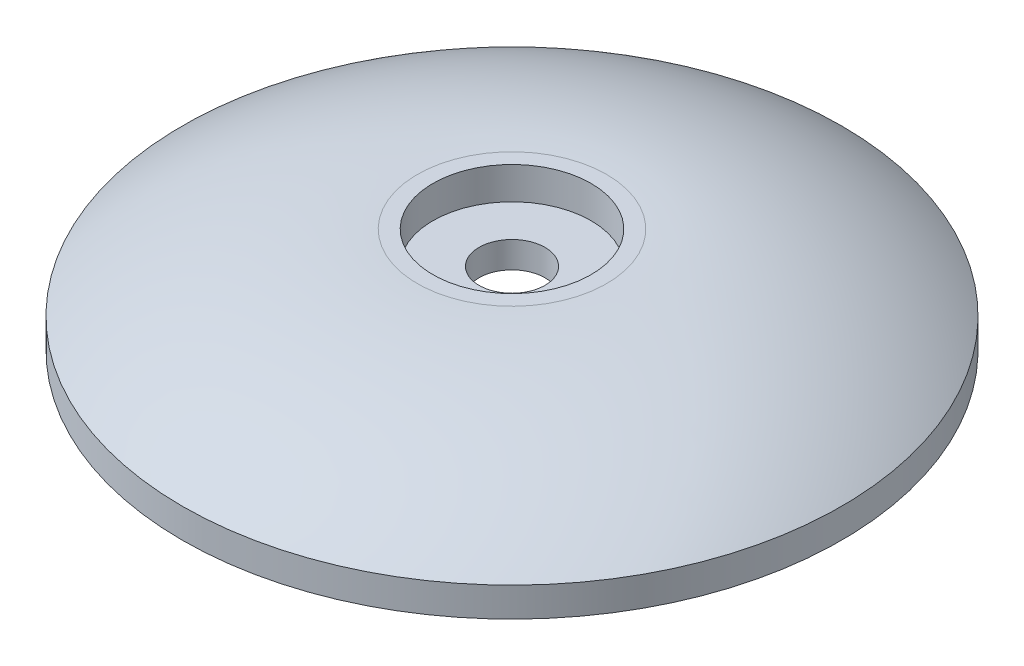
ISO-10303-21;
HEADER;
FILE_DESCRIPTION(('STEP AP214'),'2;1');
FILE_NAME('part.step','',(''),(''),'','','');
FILE_SCHEMA(('AUTOMOTIVE_DESIGN { 1 0 10303 214 1 1 1 1 }'));
ENDSEC;
DATA;
#1=APPLICATION_CONTEXT('core data for automotive mechanical design processes');
#2=APPLICATION_PROTOCOL_DEFINITION('international standard','automotive_design',2000,#1);
#3=PRODUCT_CONTEXT('',#1,'mechanical');
#4=PRODUCT('Part','Part','',(#3));
#5=PRODUCT_RELATED_PRODUCT_CATEGORY('part','',(#4));
#6=PRODUCT_DEFINITION_FORMATION('','',#4);
#7=PRODUCT_DEFINITION_CONTEXT('part definition',#1,'design');
#8=PRODUCT_DEFINITION('design','',#6,#7);
#9=PRODUCT_DEFINITION_SHAPE('','',#8);
#10=(LENGTH_UNIT() NAMED_UNIT(*) SI_UNIT(.MILLI.,.METRE.));
#11=(NAMED_UNIT(*) PLANE_ANGLE_UNIT() SI_UNIT($,.RADIAN.));
#12=(NAMED_UNIT(*) SI_UNIT($,.STERADIAN.) SOLID_ANGLE_UNIT());
#13=UNCERTAINTY_MEASURE_WITH_UNIT(LENGTH_MEASURE(1.E-05),#10,'distance_accuracy_value','');
#14=(GEOMETRIC_REPRESENTATION_CONTEXT(3) GLOBAL_UNCERTAINTY_ASSIGNED_CONTEXT((#13)) GLOBAL_UNIT_ASSIGNED_CONTEXT((#10,
#11,#12)) REPRESENTATION_CONTEXT('',''));
#15=CARTESIAN_POINT('',(0.,0.,0.));
#16=DIRECTION('',(0.,0.,1.));
#17=DIRECTION('',(1.,0.,0.));
#18=AXIS2_PLACEMENT_3D('',#15,#16,#17);
#19=CARTESIAN_POINT('',(0.,-21.9889981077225,0.));
#20=DIRECTION('',(0.,-1.,0.));
#21=DIRECTION('',(0.,0.,-1.));
#22=AXIS2_PLACEMENT_3D('',#19,#20,#21);
#23=DEGENERATE_TOROIDAL_SURFACE('',#22,7.83467904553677,28.596351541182,.T.);
#24=CARTESIAN_POINT('',(0.,0.882448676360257,0.));
#25=DIRECTION('',(0.,-1.,0.));
#26=DIRECTION('',(0.,0.,-1.));
#27=AXIS2_PLACEMENT_3D('',#24,#25,#26);
#28=CIRCLE('',#27,25.);
#29=CARTESIAN_POINT('',(0.,0.882448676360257,-25.));
#30=VERTEX_POINT('',#29);
#31=EDGE_CURVE('E65',#30,#30,#28,.T.);
#32=ORIENTED_EDGE('',*,*,#31,.F.);
#33=EDGE_LOOP('',(#32));
#34=FACE_BOUND('',#33,.T.);
#35=CARTESIAN_POINT('',(0.,6.59982268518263,0.));
#36=DIRECTION('',(0.,-1.,0.));
#37=DIRECTION('',(0.,0.,-1.));
#38=AXIS2_PLACEMENT_3D('',#35,#36,#37);
#39=CIRCLE('',#38,7.17844194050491);
#40=CARTESIAN_POINT('',(0.,6.59982268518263,-7.17844194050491));
#41=VERTEX_POINT('',#40);
#42=EDGE_CURVE('E10',#41,#41,#39,.T.);
#43=ORIENTED_EDGE('',*,*,#42,.T.);
#44=EDGE_LOOP('',(#43));
#45=FACE_BOUND('',#44,.T.);
#46=ADVANCED_FACE('F34',(#34,#45),#23,.T.);
#47=CARTESIAN_POINT('',(0.,6.59982268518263,0.));
#48=DIRECTION('',(0.,-1.,0.));
#49=DIRECTION('',(0.,0.,-1.));
#50=AXIS2_PLACEMENT_3D('',#47,#48,#49);
#51=PLANE('',#50);
#52=ORIENTED_EDGE('',*,*,#42,.F.);
#53=EDGE_LOOP('',(#52));
#54=FACE_BOUND('',#53,.T.);
#55=CARTESIAN_POINT('',(0.,6.59982268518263,0.));
#56=DIRECTION('',(0.,-1.,0.));
#57=DIRECTION('',(0.,0.,-1.));
#58=AXIS2_PLACEMENT_3D('',#55,#56,#57);
#59=CIRCLE('',#58,6.);
#60=CARTESIAN_POINT('',(0.,6.59982268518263,-6.));
#61=VERTEX_POINT('',#60);
#62=EDGE_CURVE('E40',#61,#61,#59,.T.);
#63=ORIENTED_EDGE('',*,*,#62,.T.);
#64=EDGE_LOOP('',(#63));
#65=FACE_BOUND('',#64,.T.);
#66=ADVANCED_FACE('F72',(#54,#65),#51,.F.);
#67=CARTESIAN_POINT('',(0.,0.,0.));
#68=DIRECTION('',(0.,-1.,0.));
#69=DIRECTION('',(0.,0.,-1.));
#70=AXIS2_PLACEMENT_3D('',#67,#68,#69);
#71=CYLINDRICAL_SURFACE('',#70,6.);
#72=ORIENTED_EDGE('',*,*,#62,.F.);
#73=EDGE_LOOP('',(#72));
#74=FACE_BOUND('',#73,.T.);
#75=CARTESIAN_POINT('',(0.,4.14839619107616,0.));
#76=DIRECTION('',(0.,-1.,0.));
#77=DIRECTION('',(0.,0.,-1.));
#78=AXIS2_PLACEMENT_3D('',#75,#76,#77);
#79=CIRCLE('',#78,6.);
#80=CARTESIAN_POINT('',(0.,4.14839619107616,-6.));
#81=VERTEX_POINT('',#80);
#82=EDGE_CURVE('E44',#81,#81,#79,.T.);
#83=ORIENTED_EDGE('',*,*,#82,.T.);
#84=EDGE_LOOP('',(#83));
#85=FACE_BOUND('',#84,.T.);
#86=ADVANCED_FACE('F76',(#74,#85),#71,.F.);
#87=CARTESIAN_POINT('',(0.,4.14839619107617,0.));
#88=DIRECTION('',(0.,-1.,0.));
#89=DIRECTION('',(0.,0.,-1.));
#90=AXIS2_PLACEMENT_3D('',#87,#88,#89);
#91=PLANE('',#90);
#92=ORIENTED_EDGE('',*,*,#82,.F.);
#93=EDGE_LOOP('',(#92));
#94=FACE_BOUND('',#93,.T.);
#95=CARTESIAN_POINT('',(0.,4.14839619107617,0.));
#96=DIRECTION('',(0.,-1.,0.));
#97=DIRECTION('',(0.,0.,-1.));
#98=AXIS2_PLACEMENT_3D('',#95,#96,#97);
#99=CIRCLE('',#98,2.5);
#100=CARTESIAN_POINT('',(0.,4.14839619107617,-2.5));
#101=VERTEX_POINT('',#100);
#102=EDGE_CURVE('E48',#101,#101,#99,.T.);
#103=ORIENTED_EDGE('',*,*,#102,.T.);
#104=EDGE_LOOP('',(#103));
#105=FACE_BOUND('',#104,.T.);
#106=ADVANCED_FACE('F81',(#94,#105),#91,.F.);
#107=CARTESIAN_POINT('',(0.,0.,0.));
#108=DIRECTION('',(0.,-1.,0.));
#109=DIRECTION('',(0.,0.,-1.));
#110=AXIS2_PLACEMENT_3D('',#107,#108,#109);
#111=CYLINDRICAL_SURFACE('',#110,2.5);
#112=ORIENTED_EDGE('',*,*,#102,.F.);
#113=EDGE_LOOP('',(#112));
#114=FACE_BOUND('',#113,.T.);
#115=CARTESIAN_POINT('',(0.,2.14839619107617,0.));
#116=DIRECTION('',(0.,-1.,0.));
#117=DIRECTION('',(0.,0.,-1.));
#118=AXIS2_PLACEMENT_3D('',#115,#116,#117);
#119=CIRCLE('',#118,2.5);
#120=CARTESIAN_POINT('',(0.,2.14839619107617,-2.5));
#121=VERTEX_POINT('',#120);
#122=EDGE_CURVE('E53',#121,#121,#119,.T.);
#123=ORIENTED_EDGE('',*,*,#122,.T.);
#124=EDGE_LOOP('',(#123));
#125=FACE_BOUND('',#124,.T.);
#126=ADVANCED_FACE('F87',(#114,#125),#111,.F.);
#127=CARTESIAN_POINT('',(0.,2.14839619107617,0.));
#128=DIRECTION('',(0.,1.,0.));
#129=DIRECTION('',(0.,0.,1.));
#130=AXIS2_PLACEMENT_3D('',#127,#128,#129);
#131=PLANE('',#130);
#132=ORIENTED_EDGE('',*,*,#122,.F.);
#133=EDGE_LOOP('',(#132));
#134=FACE_BOUND('',#133,.T.);
#135=CARTESIAN_POINT('',(0.,2.14839619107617,0.));
#136=DIRECTION('',(0.,-1.,0.));
#137=DIRECTION('',(0.,0.,-1.));
#138=AXIS2_PLACEMENT_3D('',#135,#136,#137);
#139=CIRCLE('',#138,10.1);
#140=CARTESIAN_POINT('',(0.,2.14839619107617,-10.1));
#141=VERTEX_POINT('',#140);
#142=EDGE_CURVE('E56',#141,#141,#139,.T.);
#143=ORIENTED_EDGE('',*,*,#142,.T.);
#144=EDGE_LOOP('',(#143));
#145=FACE_BOUND('',#144,.T.);
#146=ADVANCED_FACE('F91',(#134,#145),#131,.F.);
#147=CARTESIAN_POINT('',(0.,0.,0.));
#148=DIRECTION('',(0.,-1.,0.));
#149=DIRECTION('',(0.,0.,-1.));
#150=AXIS2_PLACEMENT_3D('',#147,#148,#149);
#151=CYLINDRICAL_SURFACE('',#150,10.1);
#152=ORIENTED_EDGE('',*,*,#142,.F.);
#153=EDGE_LOOP('',(#152));
#154=FACE_BOUND('',#153,.T.);
#155=CARTESIAN_POINT('',(0.,-1.35160380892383,0.));
#156=DIRECTION('',(0.,-1.,0.));
#157=DIRECTION('',(0.,0.,-1.));
#158=AXIS2_PLACEMENT_3D('',#155,#156,#157);
#159=CIRCLE('',#158,10.1);
#160=CARTESIAN_POINT('',(0.,-1.35160380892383,-10.1));
#161=VERTEX_POINT('',#160);
#162=EDGE_CURVE('E59',#161,#161,#159,.T.);
#163=ORIENTED_EDGE('',*,*,#162,.T.);
#164=EDGE_LOOP('',(#163));
#165=FACE_BOUND('',#164,.T.);
#166=ADVANCED_FACE('F95',(#154,#165),#151,.F.);
#167=CARTESIAN_POINT('',(0.,-1.35160380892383,0.));
#168=DIRECTION('',(0.,1.,0.));
#169=DIRECTION('',(0.,0.,1.));
#170=AXIS2_PLACEMENT_3D('',#167,#168,#169);
#171=PLANE('',#170);
#172=ORIENTED_EDGE('',*,*,#162,.F.);
#173=EDGE_LOOP('',(#172));
#174=FACE_BOUND('',#173,.T.);
#175=CARTESIAN_POINT('',(0.,-1.35160380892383,0.));
#176=DIRECTION('',(0.,-1.,0.));
#177=DIRECTION('',(0.,0.,-1.));
#178=AXIS2_PLACEMENT_3D('',#175,#176,#177);
#179=CIRCLE('',#178,25.);
#180=CARTESIAN_POINT('',(0.,-1.35160380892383,-25.));
#181=VERTEX_POINT('',#180);
#182=EDGE_CURVE('E62',#181,#181,#179,.T.);
#183=ORIENTED_EDGE('',*,*,#182,.T.);
#184=EDGE_LOOP('',(#183));
#185=FACE_BOUND('',#184,.T.);
#186=ADVANCED_FACE('F99',(#174,#185),#171,.F.);
#187=CARTESIAN_POINT('',(0.,0.,0.));
#188=DIRECTION('',(0.,-1.,0.));
#189=DIRECTION('',(0.,0.,-1.));
#190=AXIS2_PLACEMENT_3D('',#187,#188,#189);
#191=CYLINDRICAL_SURFACE('',#190,25.);
#192=ORIENTED_EDGE('',*,*,#182,.F.);
#193=EDGE_LOOP('',(#192));
#194=FACE_BOUND('',#193,.T.);
#195=ORIENTED_EDGE('',*,*,#31,.T.);
#196=EDGE_LOOP('',(#195));
#197=FACE_BOUND('',#196,.T.);
#198=ADVANCED_FACE('F69',(#194,#197),#191,.T.);
#199=CLOSED_SHELL('',(#46,#66,#86,#106,#126,#146,#166,#186,#198));
#200=MANIFOLD_SOLID_BREP('B2',#199);
#201=ADVANCED_BREP_SHAPE_REPRESENTATION('',(#18,#200),#14);
#202=SHAPE_DEFINITION_REPRESENTATION(#9,#201);
ENDSEC;
END-ISO-10303-21;
